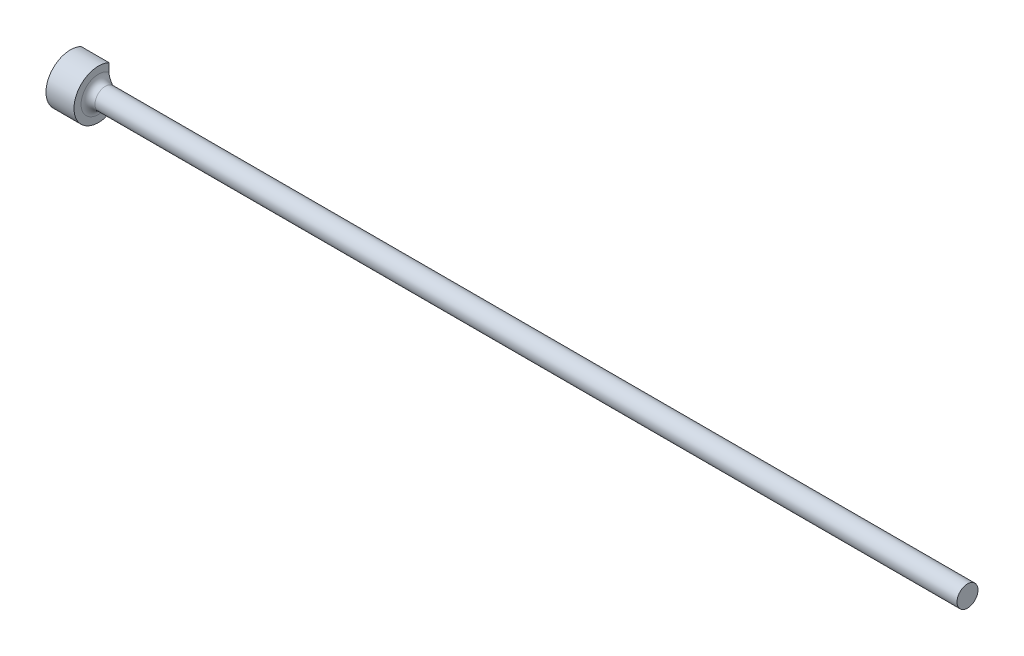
ISO-10303-21;
HEADER;
FILE_DESCRIPTION(('STEP AP214'),'2;1');
FILE_NAME('part.step','',(''),(''),'','','');
FILE_SCHEMA(('AUTOMOTIVE_DESIGN { 1 0 10303 214 1 1 1 1 }'));
ENDSEC;
DATA;
#1=APPLICATION_CONTEXT('core data for automotive mechanical design processes');
#2=APPLICATION_PROTOCOL_DEFINITION('international standard','automotive_design',2000,#1);
#3=PRODUCT_CONTEXT('',#1,'mechanical');
#4=PRODUCT('Part','Part','',(#3));
#5=PRODUCT_RELATED_PRODUCT_CATEGORY('part','',(#4));
#6=PRODUCT_DEFINITION_FORMATION('','',#4);
#7=PRODUCT_DEFINITION_CONTEXT('part definition',#1,'design');
#8=PRODUCT_DEFINITION('design','',#6,#7);
#9=PRODUCT_DEFINITION_SHAPE('','',#8);
#10=(LENGTH_UNIT() NAMED_UNIT(*) SI_UNIT(.MILLI.,.METRE.));
#11=(NAMED_UNIT(*) PLANE_ANGLE_UNIT() SI_UNIT($,.RADIAN.));
#12=(NAMED_UNIT(*) SI_UNIT($,.STERADIAN.) SOLID_ANGLE_UNIT());
#13=UNCERTAINTY_MEASURE_WITH_UNIT(LENGTH_MEASURE(1.E-05),#10,'distance_accuracy_value','');
#14=(GEOMETRIC_REPRESENTATION_CONTEXT(3) GLOBAL_UNCERTAINTY_ASSIGNED_CONTEXT((#13)) GLOBAL_UNIT_ASSIGNED_CONTEXT((#10,
#11,#12)) REPRESENTATION_CONTEXT('',''));
#15=CARTESIAN_POINT('',(0.,0.,0.));
#16=DIRECTION('',(0.,0.,1.));
#17=DIRECTION('',(1.,0.,0.));
#18=AXIS2_PLACEMENT_3D('',#15,#16,#17);
#19=CARTESIAN_POINT('',(0.,0.,0.));
#20=DIRECTION('',(1.,0.,0.));
#21=DIRECTION('',(0.,1.,0.));
#22=AXIS2_PLACEMENT_3D('',#19,#20,#21);
#23=PLANE('',#22);
#24=DIRECTION('',(0.,1.,0.));
#25=VECTOR('',#24,1.);
#26=CARTESIAN_POINT('',(0.,0.,-1.19087900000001));
#27=LINE('',#26,#25);
#28=CARTESIAN_POINT('',(0.,-2.50993739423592,-1.19087900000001));
#29=VERTEX_POINT('',#28);
#30=CARTESIAN_POINT('',(0.,2.50993739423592,-1.19087900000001));
#31=VERTEX_POINT('',#30);
#32=EDGE_CURVE('E49',#29,#31,#27,.T.);
#33=ORIENTED_EDGE('',*,*,#32,.F.);
#34=CARTESIAN_POINT('',(0.,0.,0.));
#35=DIRECTION('',(-1.,0.,0.));
#36=DIRECTION('',(0.,-1.,0.));
#37=AXIS2_PLACEMENT_3D('',#34,#35,#36);
#38=CIRCLE('',#37,2.77812499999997);
#39=EDGE_CURVE('E43',#29,#31,#38,.T.);
#40=ORIENTED_EDGE('',*,*,#39,.T.);
#41=EDGE_LOOP('',(#33,#40));
#42=FACE_BOUND('',#41,.T.);
#43=ADVANCED_FACE('F32',(#42),#23,.F.);
#44=CARTESIAN_POINT('',(101.6,0.,0.));
#45=DIRECTION('',(-1.,0.,0.));
#46=DIRECTION('',(0.,-1.,0.));
#47=AXIS2_PLACEMENT_3D('',#44,#45,#46);
#48=CYLINDRICAL_SURFACE('',#47,2.77812499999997);
#49=DIRECTION('',(-1.,0.,0.));
#50=VECTOR('',#49,1.);
#51=CARTESIAN_POINT('',(101.6,-2.50993739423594,-1.19087900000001));
#52=LINE('',#51,#50);
#53=CARTESIAN_POINT('',(3.175,-2.50993739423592,-1.19087900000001));
#54=VERTEX_POINT('',#53);
#55=EDGE_CURVE('E87',#54,#29,#52,.T.);
#56=ORIENTED_EDGE('',*,*,#55,.F.);
#57=CARTESIAN_POINT('',(3.175,0.,0.));
#58=DIRECTION('',(-1.,0.,0.));
#59=DIRECTION('',(0.,-1.,0.));
#60=AXIS2_PLACEMENT_3D('',#57,#58,#59);
#61=CIRCLE('',#60,2.77812499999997);
#62=CARTESIAN_POINT('',(3.175,2.50993739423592,-1.19087900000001));
#63=VERTEX_POINT('',#62);
#64=EDGE_CURVE('E75',#54,#63,#61,.T.);
#65=ORIENTED_EDGE('',*,*,#64,.T.);
#66=DIRECTION('',(-1.,0.,0.));
#67=VECTOR('',#66,1.);
#68=CARTESIAN_POINT('',(101.6,2.5099373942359,-1.19087900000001));
#69=LINE('',#68,#67);
#70=EDGE_CURVE('E56',#31,#63,#69,.F.);
#71=ORIENTED_EDGE('',*,*,#70,.F.);
#72=ORIENTED_EDGE('',*,*,#39,.F.);
#73=EDGE_LOOP('',(#56,#65,#71,#72));
#74=FACE_BOUND('',#73,.T.);
#75=ADVANCED_FACE('F97',(#74),#48,.T.);
#76=CARTESIAN_POINT('',(3.175,2.77812499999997,0.));
#77=DIRECTION('',(-1.,0.,0.));
#78=DIRECTION('',(0.,-1.,0.));
#79=AXIS2_PLACEMENT_3D('',#76,#77,#78);
#80=PLANE('',#79);
#81=DIRECTION('',(0.,-1.,0.));
#82=VECTOR('',#81,1.);
#83=CARTESIAN_POINT('',(3.175,2.77812499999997,-1.19087900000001));
#84=LINE('',#83,#82);
#85=CARTESIAN_POINT('',(3.175,1.57936383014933,-1.19087900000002));
#86=VERTEX_POINT('',#85);
#87=EDGE_CURVE('E84',#63,#86,#84,.T.);
#88=ORIENTED_EDGE('',*,*,#87,.F.);
#89=ORIENTED_EDGE('',*,*,#64,.F.);
#90=CARTESIAN_POINT('',(3.175,-1.57936383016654,-1.19087900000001));
#91=VERTEX_POINT('',#90);
#92=EDGE_CURVE('E80',#91,#54,#84,.T.);
#93=ORIENTED_EDGE('',*,*,#92,.F.);
#94=CARTESIAN_POINT('',(3.175,0.,0.));
#95=DIRECTION('',(-1.,0.,0.));
#96=DIRECTION('',(0.,-1.,0.));
#97=AXIS2_PLACEMENT_3D('',#94,#95,#96);
#98=CIRCLE('',#97,1.978025);
#99=EDGE_CURVE('E70',#91,#86,#98,.T.);
#100=ORIENTED_EDGE('',*,*,#99,.T.);
#101=EDGE_LOOP('',(#88,#89,#93,#100));
#102=FACE_BOUND('',#101,.T.);
#103=ADVANCED_FACE('F81',(#102),#80,.F.);
#104=CARTESIAN_POINT('',(3.9624,0.,0.));
#105=DIRECTION('',(-1.,0.,0.));
#106=DIRECTION('',(0.,-1.,0.));
#107=AXIS2_PLACEMENT_3D('',#104,#105,#106);
#108=TOROIDAL_SURFACE('',#107,1.978025,0.7874);
#109=CARTESIAN_POINT('',(3.96240000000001,0.,0.));
#110=DIRECTION('',(-1.,0.,0.));
#111=DIRECTION('',(0.,-1.,0.));
#112=AXIS2_PLACEMENT_3D('',#109,#110,#111);
#113=CIRCLE('',#112,1.190625);
#114=CARTESIAN_POINT('',(3.96240000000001,-1.190625,0.));
#115=VERTEX_POINT('',#114);
#116=EDGE_CURVE('E76',#115,#115,#113,.T.);
#117=ORIENTED_EDGE('',*,*,#116,.T.);
#118=EDGE_LOOP('',(#117));
#119=FACE_BOUND('',#118,.T.);
#120=CARTESIAN_POINT('',(3.9424016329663,0.,-1.19087900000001));
#121=CARTESIAN_POINT('',(3.9424003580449,-0.00252528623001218,-1.19087900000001));
#122=CARTESIAN_POINT('',(3.94207287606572,-0.00505209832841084,-1.19087900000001));
#123=CARTESIAN_POINT('',(3.94090009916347,-0.0100005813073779,-1.19087900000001));
#124=CARTESIAN_POINT('',(3.94004814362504,-0.012420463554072,-1.19087900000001));
#125=CARTESIAN_POINT('',(3.93603406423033,-0.0220988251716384,-1.19087900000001));
#126=CARTESIAN_POINT('',(3.93177682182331,-0.0288504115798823,-1.19087900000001));
#127=CARTESIAN_POINT('',(3.92286919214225,-0.0420606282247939,-1.19087900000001));
#128=CARTESIAN_POINT('',(3.91821640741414,-0.0485170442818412,-1.19087900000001));
#129=CARTESIAN_POINT('',(3.89492736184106,-0.0801535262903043,-1.19087900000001));
#130=CARTESIAN_POINT('',(3.87532650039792,-0.104675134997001,-1.19087900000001));
#131=CARTESIAN_POINT('',(3.83640387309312,-0.153694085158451,-1.19087900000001));
#132=CARTESIAN_POINT('',(3.81708122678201,-0.178190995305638,-1.19087900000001));
#133=CARTESIAN_POINT('',(3.75911597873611,-0.252136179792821,-1.19087900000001));
#134=CARTESIAN_POINT('',(3.72068993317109,-0.301772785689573,-1.19087900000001));
#135=CARTESIAN_POINT('',(3.64551357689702,-0.402315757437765,-1.19087900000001));
#136=CARTESIAN_POINT('',(3.60876356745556,-0.453222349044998,-1.19087900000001));
#137=CARTESIAN_POINT('',(3.5376511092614,-0.556802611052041,-1.19087900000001));
#138=CARTESIAN_POINT('',(3.50329200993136,-0.609478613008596,-1.19087900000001));
#139=CARTESIAN_POINT('',(3.43795262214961,-0.716874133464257,-1.19087900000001));
#140=CARTESIAN_POINT('',(3.4069712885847,-0.771593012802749,-1.19087900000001));
#141=CARTESIAN_POINT('',(3.33534372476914,-0.910519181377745,-1.19087900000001));
#142=CARTESIAN_POINT('',(3.29732433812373,-0.996126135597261,-1.19087900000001));
#143=CARTESIAN_POINT('',(3.23478368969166,-1.17219276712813,-1.19087900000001));
#144=CARTESIAN_POINT('',(3.21023773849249,-1.2626432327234,-1.19087900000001));
#145=CARTESIAN_POINT('',(3.18335254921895,-1.42025815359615,-1.19087900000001));
#146=CARTESIAN_POINT('',(3.17666601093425,-1.48667015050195,-1.19087900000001));
#147=CARTESIAN_POINT('',(3.17388468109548,-1.61974380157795,-1.19087900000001));
#148=CARTESIAN_POINT('',(3.17777752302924,-1.68640507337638,-1.19087900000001));
#149=CARTESIAN_POINT('',(3.19577641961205,-1.80639288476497,-1.19087900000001));
#150=CARTESIAN_POINT('',(3.20796665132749,-1.86000343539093,-1.19087900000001));
#151=CARTESIAN_POINT('',(3.24101006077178,-1.96453980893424,-1.19087900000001));
#152=CARTESIAN_POINT('',(3.26186248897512,-2.01546586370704,-1.19087900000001));
#153=CARTESIAN_POINT('',(3.31261270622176,-2.11315490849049,-1.19087900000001));
#154=CARTESIAN_POINT('',(3.34257955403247,-2.15988245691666,-1.19087900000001));
#155=CARTESIAN_POINT('',(3.41113595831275,-2.2465455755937,-1.19087900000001));
#156=CARTESIAN_POINT('',(3.44971824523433,-2.28648682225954,-1.19087900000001));
#157=CARTESIAN_POINT('',(3.52848476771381,-2.35242600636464,-1.19087900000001));
#158=CARTESIAN_POINT('',(3.56769213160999,-2.37959235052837,-1.19087900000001));
#159=CARTESIAN_POINT('',(3.65054307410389,-2.4260057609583,-1.19087900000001));
#160=CARTESIAN_POINT('',(3.69418302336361,-2.44525924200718,-1.19087900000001));
#161=CARTESIAN_POINT('',(3.77946322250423,-2.47325953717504,-1.19087900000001));
#162=CARTESIAN_POINT('',(3.82080498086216,-2.48292112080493,-1.19087900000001));
#163=CARTESIAN_POINT('',(3.90454244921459,-2.49477017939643,-1.19087900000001));
#164=CARTESIAN_POINT('',(3.9469377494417,-2.49696051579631,-1.19087900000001));
#165=CARTESIAN_POINT('',(4.02936249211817,-2.49385387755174,-1.19087900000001));
#166=CARTESIAN_POINT('',(4.06940612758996,-2.48891828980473,-1.19087900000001));
#167=CARTESIAN_POINT('',(4.14809429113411,-2.47240665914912,-1.19087900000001));
#168=CARTESIAN_POINT('',(4.18673890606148,-2.46083102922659,-1.19087900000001));
#169=CARTESIAN_POINT('',(4.26169035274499,-2.43144737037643,-1.19087900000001));
#170=CARTESIAN_POINT('',(4.2979906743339,-2.41362280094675,-1.19087900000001));
#171=CARTESIAN_POINT('',(4.36726547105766,-2.37240027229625,-1.19087900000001));
#172=CARTESIAN_POINT('',(4.4002394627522,-2.34900150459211,-1.19087900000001));
#173=CARTESIAN_POINT('',(4.46368628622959,-2.29616557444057,-1.19087900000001));
#174=CARTESIAN_POINT('',(4.49396098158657,-2.26649107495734,-1.19087900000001));
#175=CARTESIAN_POINT('',(4.54959593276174,-2.20285945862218,-1.19087900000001));
#176=CARTESIAN_POINT('',(4.57495472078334,-2.16890106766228,-1.19087900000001));
#177=CARTESIAN_POINT('',(4.62257411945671,-2.09441114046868,-1.19087900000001));
#178=CARTESIAN_POINT('',(4.64433721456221,-2.05356239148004,-1.19087900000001));
#179=CARTESIAN_POINT('',(4.68161808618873,-1.96912413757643,-1.19087900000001));
#180=CARTESIAN_POINT('',(4.69713334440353,-1.92553353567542,-1.19087900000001));
#181=CARTESIAN_POINT('',(4.72379313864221,-1.83058909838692,-1.19087900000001));
#182=CARTESIAN_POINT('',(4.73405214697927,-1.77898769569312,-1.19087900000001));
#183=CARTESIAN_POINT('',(4.74724197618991,-1.67487717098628,-1.19087900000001));
#184=CARTESIAN_POINT('',(4.75016826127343,-1.62236750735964,-1.19087900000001));
#185=CARTESIAN_POINT('',(4.74914875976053,-1.4901088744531,-1.19087900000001));
#186=CARTESIAN_POINT('',(4.74084128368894,-1.41038564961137,-1.19087900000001));
#187=CARTESIAN_POINT('',(4.71152668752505,-1.25333125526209,-1.19087900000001));
#188=CARTESIAN_POINT('',(4.69049317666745,-1.17600540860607,-1.19087900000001));
#189=CARTESIAN_POINT('',(4.6229498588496,-0.980067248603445,-1.19087900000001));
#190=CARTESIAN_POINT('',(4.56872910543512,-0.864155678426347,-1.19087900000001));
#191=CARTESIAN_POINT('',(4.44434683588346,-0.641544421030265,-1.19087900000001));
#192=CARTESIAN_POINT('',(4.37415306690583,-0.534863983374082,-1.19087900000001));
#193=CARTESIAN_POINT('',(4.26173105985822,-0.378278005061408,-1.19087900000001));
#194=CARTESIAN_POINT('',(4.22258000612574,-0.326081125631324,-1.19087900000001));
#195=CARTESIAN_POINT('',(4.14571101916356,-0.226356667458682,-1.19087900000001));
#196=CARTESIAN_POINT('',(4.10808424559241,-0.178757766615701,-1.19087900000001));
#197=CARTESIAN_POINT('',(4.05687402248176,-0.113911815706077,-1.19087900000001));
#198=CARTESIAN_POINT('',(4.04328023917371,-0.0966923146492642,-1.19087900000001));
#199=CARTESIAN_POINT('',(4.02013803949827,-0.0667983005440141,-1.19087900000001));
#200=CARTESIAN_POINT('',(4.01050663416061,-0.0541782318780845,-1.19087900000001));
#201=CARTESIAN_POINT('',(3.99641937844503,-0.0340995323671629,-1.19087900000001));
#202=CARTESIAN_POINT('',(3.99162005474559,-0.0269357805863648,-1.19087900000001));
#203=CARTESIAN_POINT('',(3.98679104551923,-0.0172365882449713,-1.19087900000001));
#204=CARTESIAN_POINT('',(3.98585486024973,-0.0151860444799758,-1.19087900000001));
#205=CARTESIAN_POINT('',(3.98424854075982,-0.0109842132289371,-1.19087900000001));
#206=CARTESIAN_POINT('',(3.98357757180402,-0.00883326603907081,-1.19087900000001));
#207=CARTESIAN_POINT('',(3.98273915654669,-0.00486517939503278,-1.19087900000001));
#208=CARTESIAN_POINT('',(3.9824992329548,-0.00306433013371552,-1.19087900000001));
#209=CARTESIAN_POINT('',(3.98234982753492,0.000547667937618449,-1.19087900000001));
#210=CARTESIAN_POINT('',(3.98243953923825,0.00235878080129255,-1.19087900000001));
#211=CARTESIAN_POINT('',(3.98299412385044,0.00647312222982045,-1.19087900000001));
#212=CARTESIAN_POINT('',(3.98356322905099,0.00876143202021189,-1.19087900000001));
#213=CARTESIAN_POINT('',(3.98504860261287,0.013233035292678,-1.19087900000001));
#214=CARTESIAN_POINT('',(3.9859677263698,0.0154152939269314,-1.19087900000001));
#215=CARTESIAN_POINT('',(3.99110572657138,0.026401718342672,-1.19087900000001));
#216=CARTESIAN_POINT('',(3.99664062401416,0.0345311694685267,-1.19087900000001));
#217=CARTESIAN_POINT('',(4.00802330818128,0.0505284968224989,-1.19087900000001));
#218=CARTESIAN_POINT('',(4.0138725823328,0.0583947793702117,-1.19087900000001));
#219=CARTESIAN_POINT('',(4.04310105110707,0.0970949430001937,-1.19087900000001));
#220=CARTESIAN_POINT('',(4.067365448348,0.127330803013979,-1.19087900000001));
#221=CARTESIAN_POINT('',(4.1154749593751,0.18794909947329,-1.19087900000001));
#222=CARTESIAN_POINT('',(4.13932098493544,0.218330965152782,-1.19087900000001));
#223=CARTESIAN_POINT('',(4.2109546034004,0.310728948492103,-1.19087900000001));
#224=CARTESIAN_POINT('',(4.25819391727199,0.373207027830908,-1.19087900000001));
#225=CARTESIAN_POINT('',(4.34937148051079,0.500507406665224,-1.19087900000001));
#226=CARTESIAN_POINT('',(4.39330834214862,0.565330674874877,-1.19087900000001));
#227=CARTESIAN_POINT('',(4.51753279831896,0.764200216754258,-1.19087900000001));
#228=CARTESIAN_POINT('',(4.59073054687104,0.903226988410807,-1.19087900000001));
#229=CARTESIAN_POINT('',(4.67114556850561,1.11589736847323,-1.19087900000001));
#230=CARTESIAN_POINT('',(4.69261655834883,1.18410675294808,-1.19087900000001));
#231=CARTESIAN_POINT('',(4.72617021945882,1.32295856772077,-1.19087900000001));
#232=CARTESIAN_POINT('',(4.73824330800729,1.39360340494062,-1.19087900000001));
#233=CARTESIAN_POINT('',(4.75105500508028,1.53676052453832,-1.19087900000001));
#234=CARTESIAN_POINT('',(4.75167124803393,1.60928469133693,-1.19087900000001));
#235=CARTESIAN_POINT('',(4.73931469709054,1.75316563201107,-1.19087900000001));
#236=CARTESIAN_POINT('',(4.72637328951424,1.82452471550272,-1.19087900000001));
#237=CARTESIAN_POINT('',(4.69161475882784,1.94244799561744,-1.19087900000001));
#238=CARTESIAN_POINT('',(4.67353695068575,1.99012215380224,-1.19087900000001));
#239=CARTESIAN_POINT('',(4.62978207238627,2.08188667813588,-1.19087900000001));
#240=CARTESIAN_POINT('',(4.60410725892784,2.12597810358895,-1.19087900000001));
#241=CARTESIAN_POINT('',(4.54513635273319,2.20920371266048,-1.19087900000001));
#242=CARTESIAN_POINT('',(4.51179247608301,2.24830431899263,-1.19087900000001));
#243=CARTESIAN_POINT('',(4.43824242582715,2.31943761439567,-1.19087900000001));
#244=CARTESIAN_POINT('',(4.3980402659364,2.35147441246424,-1.19087900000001));
#245=CARTESIAN_POINT('',(4.31692600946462,2.40366026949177,-1.19087900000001));
#246=CARTESIAN_POINT('',(4.27661711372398,2.42474808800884,-1.19087900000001));
#247=CARTESIAN_POINT('',(4.19279859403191,2.45911320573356,-1.19087900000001));
#248=CARTESIAN_POINT('',(4.1492909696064,2.47239533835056,-1.19087900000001));
#249=CARTESIAN_POINT('',(4.06441994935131,2.48972479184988,-1.19087900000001));
#250=CARTESIAN_POINT('',(4.02319869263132,2.4944742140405,-1.19087900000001));
#251=CARTESIAN_POINT('',(3.94056254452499,2.49673793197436,-1.19087900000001));
#252=CARTESIAN_POINT('',(3.8991477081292,2.4942541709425,-1.19087900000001));
#253=CARTESIAN_POINT('',(3.81866940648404,2.4823513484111,-1.19087900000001));
#254=CARTESIAN_POINT('',(3.77957295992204,2.47315302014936,-1.19087900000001));
#255=CARTESIAN_POINT('',(3.70343991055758,2.44843290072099,-1.19087900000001));
#256=CARTESIAN_POINT('',(3.66640333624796,2.43291102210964,-1.19087900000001));
#257=CARTESIAN_POINT('',(3.59468634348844,2.39579013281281,-1.19087900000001));
#258=CARTESIAN_POINT('',(3.56005932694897,2.37408827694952,-1.19087900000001));
#259=CARTESIAN_POINT('',(3.4946700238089,2.32549848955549,-1.19087900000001));
#260=CARTESIAN_POINT('',(3.46390850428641,2.29860953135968,-1.19087900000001));
#261=CARTESIAN_POINT('',(3.40501986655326,2.23869337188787,-1.19087900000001));
#262=CARTESIAN_POINT('',(3.37717638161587,2.20538807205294,-1.19087900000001));
#263=CARTESIAN_POINT('',(3.32685520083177,2.13495808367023,-1.19087900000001));
#264=CARTESIAN_POINT('',(3.30437932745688,2.09783210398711,-1.19087900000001));
#265=CARTESIAN_POINT('',(3.26284483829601,2.01670175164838,-1.19087900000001));
#266=CARTESIAN_POINT('',(3.24439809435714,1.97238506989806,-1.19087900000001));
#267=CARTESIAN_POINT('',(3.21412426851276,1.8815625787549,-1.19087900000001));
#268=CARTESIAN_POINT('',(3.20230010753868,1.8350558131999,-1.19087900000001));
#269=CARTESIAN_POINT('',(3.18362748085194,1.73373033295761,-1.19087900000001));
#270=CARTESIAN_POINT('',(3.17780910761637,1.67872310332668,-1.19087900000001));
#271=CARTESIAN_POINT('',(3.17379115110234,1.568455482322,-1.19087900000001));
#272=CARTESIAN_POINT('',(3.17559625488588,1.51319495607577,-1.19087900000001));
#273=CARTESIAN_POINT('',(3.18904853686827,1.37081017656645,-1.19087900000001));
#274=CARTESIAN_POINT('',(3.20588485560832,1.28416878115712,-1.19087900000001));
#275=CARTESIAN_POINT('',(3.2530898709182,1.11467666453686,-1.19087900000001));
#276=CARTESIAN_POINT('',(3.28349025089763,1.03183532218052,-1.19087900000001));
#277=CARTESIAN_POINT('',(3.3569349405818,0.865002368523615,-1.19087900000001));
#278=CARTESIAN_POINT('',(3.40072344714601,0.781346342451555,-1.19087900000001));
#279=CARTESIAN_POINT('',(3.49629244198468,0.618915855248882,-1.19087900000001));
#280=CARTESIAN_POINT('',(3.54806979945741,0.540139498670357,-1.19087900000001));
#281=CARTESIAN_POINT('',(3.65752533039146,0.384858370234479,-1.19087900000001));
#282=CARTESIAN_POINT('',(3.71528958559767,0.308415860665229,-1.19087900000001));
#283=CARTESIAN_POINT('',(3.80592895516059,0.192288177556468,-1.19087900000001));
#284=CARTESIAN_POINT('',(3.83796531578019,0.151946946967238,-1.19087900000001));
#285=CARTESIAN_POINT('',(3.88443418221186,0.0929311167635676,-1.19087900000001));
#286=CARTESIAN_POINT('',(3.89901208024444,0.0743443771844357,-1.19087900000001));
#287=CARTESIAN_POINT('',(3.92003162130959,0.0461732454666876,-1.19087900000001));
#288=CARTESIAN_POINT('',(3.92680039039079,0.0368773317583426,-1.19087900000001));
#289=CARTESIAN_POINT('',(3.93424766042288,0.0244249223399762,-1.19087900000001));
#290=CARTESIAN_POINT('',(3.935744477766,0.0217805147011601,-1.19087900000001));
#291=CARTESIAN_POINT('',(3.93845580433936,0.0163444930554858,-1.19087900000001));
#292=CARTESIAN_POINT('',(3.9396707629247,0.013553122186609,-1.19087900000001));
#293=CARTESIAN_POINT('',(3.94116039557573,0.00893782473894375,-1.19087900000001));
#294=CARTESIAN_POINT('',(3.94161673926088,0.00717546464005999,-1.19087900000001));
#295=CARTESIAN_POINT('',(3.94223684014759,0.0036087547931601,-1.19087900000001));
#296=CARTESIAN_POINT('',(3.94240254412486,0.00180476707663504,-1.19087900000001));
#297=CARTESIAN_POINT('',(3.9424016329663,0.,-1.19087900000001));
#298=B_SPLINE_CURVE_WITH_KNOTS('',3,(#120,#121,#122,#123,#124,#125,#126,#127,#128,#129,#130,
#131,#132,#133,#134,#135,#136,#137,#138,#139,#140,#141,#142,#143,#144,#145,#146,#147,#148,#149,
#150,#151,#152,#153,#154,#155,#156,#157,#158,#159,#160,#161,#162,#163,#164,#165,#166,#167,#168,
#169,#170,#171,#172,#173,#174,#175,#176,#177,#178,#179,#180,#181,#182,#183,#184,#185,#186,#187,
#188,#189,#190,#191,#192,#193,#194,#195,#196,#197,#198,#199,#200,#201,#202,#203,#204,#205,#206,
#207,#208,#209,#210,#211,#212,#213,#214,#215,#216,#217,#218,#219,#220,#221,#222,#223,#224,#225,
#226,#227,#228,#229,#230,#231,#232,#233,#234,#235,#236,#237,#238,#239,#240,#241,#242,#243,#244,
#245,#246,#247,#248,#249,#250,#251,#252,#253,#254,#255,#256,#257,#258,#259,#260,#261,#262,#263,
#264,#265,#266,#267,#268,#269,#270,#271,#272,#273,#274,#275,#276,#277,#278,#279,#280,#281,#282,
#283,#284,#285,#286,#287,#288,#289,#290,#291,#292,#293,#294,#295,#296,#297),.UNSPECIFIED.,.T.,
.F.,(4,2,2,2,2,2,2,2,2,2,2,2,2,2,2,2,2,2,2,2,2,2,2,2,2,2,2,2,2,2,2,2,2,2,2,2,2,2,2,2,2,2,2,2,2,
2,2,2,2,2,2,2,2,2,2,2,2,2,2,2,2,2,2,2,2,2,2,2,2,2,2,2,2,2,2,2,2,2,2,2,2,2,2,2,2,2,2,2,4),(0.,
0.00756549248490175,0.0152291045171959,0.0389809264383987,0.0628886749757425,0.156959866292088,
0.250587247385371,0.438866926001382,0.627180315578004,0.815752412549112,1.00426599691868,
1.284455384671,1.56412961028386,1.76368184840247,1.9630009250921,2.1272792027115,
2.29154326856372,2.45708432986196,2.62248623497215,2.7647801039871,2.90695838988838,
3.03367766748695,3.16034840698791,3.28081632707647,3.40127675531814,3.52205847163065,
3.64285771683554,3.76950018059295,3.89618039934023,4.0344800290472,4.17283534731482,
4.33007359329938,4.4874090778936,4.72651052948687,4.96610952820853,5.34775300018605,
5.73017403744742,5.92589687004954,6.10793662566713,6.17373216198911,6.22140603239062,
6.24715928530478,6.25391142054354,6.26064213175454,6.26606579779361,6.27147620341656,
6.2785056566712,6.28559372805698,6.31488950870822,6.34433878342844,6.46053272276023,
6.57643021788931,6.81128577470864,7.04623947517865,7.5138648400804,7.72786834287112,
7.94208977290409,8.15859790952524,8.37460592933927,8.5269602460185,8.67926935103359,
8.83255447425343,8.98575019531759,9.12148469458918,9.25713505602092,9.38099940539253,
9.50483048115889,9.62476425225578,9.7446996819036,9.86676106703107,9.9888466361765,
10.1185403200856,10.2482779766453,10.3917218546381,10.5352289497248,10.7005591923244,
10.8659910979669,11.1292568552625,11.3931408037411,11.6757518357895,11.9582523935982,
12.2456054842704,12.4001197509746,12.4710249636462,12.5054488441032,12.5145589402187,
12.5236544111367,12.5290979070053,12.5345047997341),.UNSPECIFIED.);
#299=EDGE_CURVE('E12',#86,#91,#298,.T.);
#300=ORIENTED_EDGE('',*,*,#299,.F.);
#301=ORIENTED_EDGE('',*,*,#99,.F.);
#302=EDGE_LOOP('',(#300,#301));
#303=FACE_BOUND('',#302,.T.);
#304=ADVANCED_FACE('F72',(#119,#303),#108,.F.);
#305=CARTESIAN_POINT('',(101.6,0.,0.));
#306=DIRECTION('',(-1.,0.,0.));
#307=DIRECTION('',(0.,-1.,0.));
#308=AXIS2_PLACEMENT_3D('',#305,#306,#307);
#309=CYLINDRICAL_SURFACE('',#308,1.19062500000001);
#310=ORIENTED_EDGE('',*,*,#116,.F.);
#311=EDGE_LOOP('',(#310));
#312=FACE_BOUND('',#311,.T.);
#313=CARTESIAN_POINT('',(101.6,0.,0.));
#314=DIRECTION('',(-1.,0.,0.));
#315=DIRECTION('',(0.,-1.,0.));
#316=AXIS2_PLACEMENT_3D('',#313,#314,#315);
#317=CIRCLE('',#316,1.19062500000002);
#318=CARTESIAN_POINT('',(101.6,-1.19062500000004,0.));
#319=VERTEX_POINT('',#318);
#320=EDGE_CURVE('E92',#319,#319,#317,.T.);
#321=ORIENTED_EDGE('',*,*,#320,.T.);
#322=EDGE_LOOP('',(#321));
#323=FACE_BOUND('',#322,.T.);
#324=ADVANCED_FACE('F107',(#312,#323),#309,.T.);
#325=CARTESIAN_POINT('',(101.6,1.190625,0.));
#326=DIRECTION('',(-1.,0.,0.));
#327=DIRECTION('',(0.,-1.,0.));
#328=AXIS2_PLACEMENT_3D('',#325,#326,#327);
#329=PLANE('',#328);
#330=ORIENTED_EDGE('',*,*,#320,.F.);
#331=EDGE_LOOP('',(#330));
#332=FACE_BOUND('',#331,.T.);
#333=ADVANCED_FACE('F111',(#332),#329,.F.);
#334=CARTESIAN_POINT('',(0.,0.,-1.19087900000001));
#335=DIRECTION('',(0.,0.,-1.));
#336=DIRECTION('',(0.,1.,0.));
#337=AXIS2_PLACEMENT_3D('',#334,#335,#336);
#338=PLANE('',#337);
#339=ORIENTED_EDGE('',*,*,#55,.T.);
#340=ORIENTED_EDGE('',*,*,#32,.T.);
#341=ORIENTED_EDGE('',*,*,#70,.T.);
#342=ORIENTED_EDGE('',*,*,#87,.T.);
#343=ORIENTED_EDGE('',*,*,#299,.T.);
#344=ORIENTED_EDGE('',*,*,#92,.T.);
#345=EDGE_LOOP('',(#339,#340,#341,#342,#343,#344));
#346=FACE_BOUND('',#345,.T.);
#347=ADVANCED_FACE('F86',(#346),#338,.T.);
#348=CLOSED_SHELL('',(#43,#75,#103,#304,#324,#333,#347));
#349=MANIFOLD_SOLID_BREP('B2',#348);
#350=ADVANCED_BREP_SHAPE_REPRESENTATION('',(#18,#349),#14);
#351=SHAPE_DEFINITION_REPRESENTATION(#9,#350);
ENDSEC;
END-ISO-10303-21;
